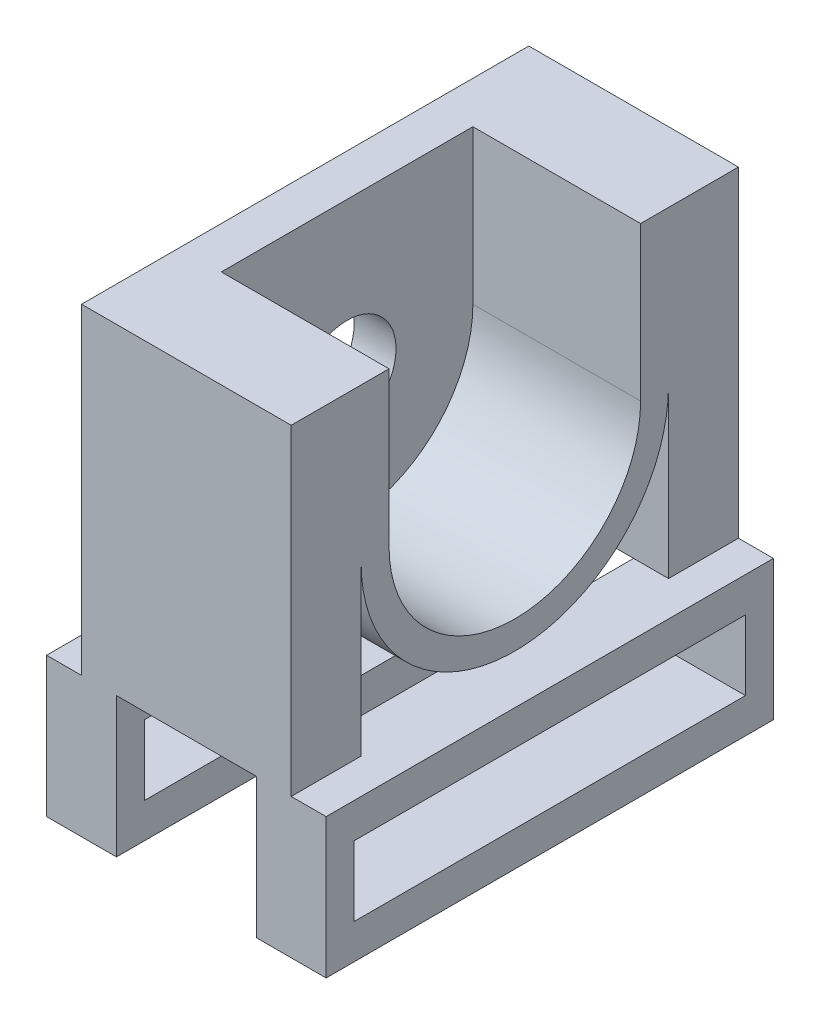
ISO-10303-21;
HEADER;
FILE_DESCRIPTION(('STEP AP214'),'2;1');
FILE_NAME('part.step','',(''),(''),'','','');
FILE_SCHEMA(('AUTOMOTIVE_DESIGN { 1 0 10303 214 1 1 1 1 }'));
ENDSEC;
DATA;
#1=APPLICATION_CONTEXT('core data for automotive mechanical design processes');
#2=APPLICATION_PROTOCOL_DEFINITION('international standard','automotive_design',2000,#1);
#3=PRODUCT_CONTEXT('',#1,'mechanical');
#4=PRODUCT('Part','Part','',(#3));
#5=PRODUCT_RELATED_PRODUCT_CATEGORY('part','',(#4));
#6=PRODUCT_DEFINITION_FORMATION('','',#4);
#7=PRODUCT_DEFINITION_CONTEXT('part definition',#1,'design');
#8=PRODUCT_DEFINITION('design','',#6,#7);
#9=PRODUCT_DEFINITION_SHAPE('','',#8);
#10=(LENGTH_UNIT() NAMED_UNIT(*) SI_UNIT(.MILLI.,.METRE.));
#11=(NAMED_UNIT(*) PLANE_ANGLE_UNIT() SI_UNIT($,.RADIAN.));
#12=(NAMED_UNIT(*) SI_UNIT($,.STERADIAN.) SOLID_ANGLE_UNIT());
#13=UNCERTAINTY_MEASURE_WITH_UNIT(LENGTH_MEASURE(1.E-05),#10,'distance_accuracy_value','');
#14=(GEOMETRIC_REPRESENTATION_CONTEXT(3) GLOBAL_UNCERTAINTY_ASSIGNED_CONTEXT((#13)) GLOBAL_UNIT_ASSIGNED_CONTEXT((#10,
#11,#12)) REPRESENTATION_CONTEXT('',''));
#15=CARTESIAN_POINT('',(0.,0.,0.));
#16=DIRECTION('',(0.,0.,1.));
#17=DIRECTION('',(1.,0.,0.));
#18=AXIS2_PLACEMENT_3D('',#15,#16,#17);
#19=CARTESIAN_POINT('',(0.,-22.,0.));
#20=DIRECTION('',(0.,-1.,0.));
#21=DIRECTION('',(0.,0.,-1.));
#22=AXIS2_PLACEMENT_3D('',#19,#20,#21);
#23=PLANE('',#22);
#24=DIRECTION('',(1.,0.,0.));
#25=VECTOR('',#24,1.);
#26=CARTESIAN_POINT('',(0.,-22.,-16.));
#27=LINE('',#26,#25);
#28=CARTESIAN_POINT('',(-2.5,-22.,-16.));
#29=VERTEX_POINT('',#28);
#30=CARTESIAN_POINT('',(2.5,-22.,-16.));
#31=VERTEX_POINT('',#30);
#32=EDGE_CURVE('E450',#29,#31,#27,.T.);
#33=ORIENTED_EDGE('',*,*,#32,.T.);
#34=DIRECTION('',(0.,0.,1.));
#35=VECTOR('',#34,1.);
#36=CARTESIAN_POINT('',(2.5,-22.,-16.));
#37=LINE('',#36,#35);
#38=CARTESIAN_POINT('',(2.5,-22.,16.));
#39=VERTEX_POINT('',#38);
#40=EDGE_CURVE('E308',#31,#39,#37,.T.);
#41=ORIENTED_EDGE('',*,*,#40,.T.);
#42=DIRECTION('',(-1.,0.,0.));
#43=VECTOR('',#42,1.);
#44=CARTESIAN_POINT('',(0.,-22.,16.));
#45=LINE('',#44,#43);
#46=CARTESIAN_POINT('',(-2.5,-22.,16.));
#47=VERTEX_POINT('',#46);
#48=EDGE_CURVE('E454',#39,#47,#45,.T.);
#49=ORIENTED_EDGE('',*,*,#48,.T.);
#50=DIRECTION('',(0.,0.,1.));
#51=VECTOR('',#50,1.);
#52=CARTESIAN_POINT('',(-2.5,-22.,-16.));
#53=LINE('',#52,#51);
#54=EDGE_CURVE('E394',#29,#47,#53,.T.);
#55=ORIENTED_EDGE('',*,*,#54,.F.);
#56=EDGE_LOOP('',(#33,#41,#49,#55));
#57=FACE_BOUND('',#56,.T.);
#58=ADVANCED_FACE('F67',(#57),#23,.T.);
#59=CARTESIAN_POINT('',(0.,-12.,-16.002));
#60=DIRECTION('',(0.,-1.,0.));
#61=DIRECTION('',(1.,0.,0.));
#62=AXIS2_PLACEMENT_3D('',#59,#60,#61);
#63=PLANE('',#62);
#64=DIRECTION('',(0.,0.,1.));
#65=VECTOR('',#64,1.);
#66=CARTESIAN_POINT('',(2.5,-12.,-16.));
#67=LINE('',#66,#65);
#68=CARTESIAN_POINT('',(2.5,-12.,-11.));
#69=VERTEX_POINT('',#68);
#70=CARTESIAN_POINT('',(2.5,-12.,11.));
#71=VERTEX_POINT('',#70);
#72=EDGE_CURVE('E309',#69,#71,#67,.T.);
#73=ORIENTED_EDGE('',*,*,#72,.F.);
#74=DIRECTION('',(-1.,0.,0.));
#75=VECTOR('',#74,1.);
#76=CARTESIAN_POINT('',(0.,-12.,-11.));
#77=LINE('',#76,#75);
#78=CARTESIAN_POINT('',(0.,-12.,-11.));
#79=VERTEX_POINT('',#78);
#80=EDGE_CURVE('E443',#69,#79,#77,.T.);
#81=ORIENTED_EDGE('',*,*,#80,.T.);
#82=DIRECTION('',(0.,0.,1.));
#83=VECTOR('',#82,1.);
#84=CARTESIAN_POINT('',(0.,-12.,-16.));
#85=LINE('',#84,#83);
#86=CARTESIAN_POINT('',(0.,-12.,-16.));
#87=VERTEX_POINT('',#86);
#88=EDGE_CURVE('E371',#87,#79,#85,.T.);
#89=ORIENTED_EDGE('',*,*,#88,.F.);
#90=DIRECTION('',(1.,0.,0.));
#91=VECTOR('',#90,1.);
#92=CARTESIAN_POINT('',(-2.5,-12.,-16.));
#93=LINE('',#92,#91);
#94=CARTESIAN_POINT('',(-2.5,-12.,-16.));
#95=VERTEX_POINT('',#94);
#96=EDGE_CURVE('E407',#95,#87,#93,.T.);
#97=ORIENTED_EDGE('',*,*,#96,.F.);
#98=DIRECTION('',(0.,0.,1.));
#99=VECTOR('',#98,1.);
#100=CARTESIAN_POINT('',(-2.5,-12.,-16.));
#101=LINE('',#100,#99);
#102=CARTESIAN_POINT('',(-2.5,-12.,16.));
#103=VERTEX_POINT('',#102);
#104=EDGE_CURVE('E387',#95,#103,#101,.T.);
#105=ORIENTED_EDGE('',*,*,#104,.T.);
#106=DIRECTION('',(1.,0.,0.));
#107=VECTOR('',#106,1.);
#108=CARTESIAN_POINT('',(-2.5,-12.,16.));
#109=LINE('',#108,#107);
#110=CARTESIAN_POINT('',(0.,-12.,16.));
#111=VERTEX_POINT('',#110);
#112=EDGE_CURVE('E402',#103,#111,#109,.T.);
#113=ORIENTED_EDGE('',*,*,#112,.T.);
#114=CARTESIAN_POINT('',(0.,-12.,11.));
#115=VERTEX_POINT('',#114);
#116=EDGE_CURVE('E406',#115,#111,#85,.T.);
#117=ORIENTED_EDGE('',*,*,#116,.F.);
#118=DIRECTION('',(1.,0.,0.));
#119=VECTOR('',#118,1.);
#120=CARTESIAN_POINT('',(0.,-12.,11.));
#121=LINE('',#120,#119);
#122=EDGE_CURVE('E439',#115,#71,#121,.T.);
#123=ORIENTED_EDGE('',*,*,#122,.T.);
#124=EDGE_LOOP('',(#73,#81,#89,#97,#105,#113,#117,#123));
#125=FACE_BOUND('',#124,.T.);
#126=ADVANCED_FACE('F677',(#125),#63,.F.);
#127=CARTESIAN_POINT('',(17.5,0.,-14.));
#128=DIRECTION('',(0.,0.,1.));
#129=DIRECTION('',(1.,0.,0.));
#130=AXIS2_PLACEMENT_3D('',#127,#128,#129);
#131=PLANE('',#130);
#132=DIRECTION('',(-1.,0.,0.));
#133=VECTOR('',#132,1.);
#134=CARTESIAN_POINT('',(17.5,-19.5,-14.));
#135=LINE('',#134,#133);
#136=CARTESIAN_POINT('',(2.5,-19.5,-14.));
#137=VERTEX_POINT('',#136);
#138=CARTESIAN_POINT('',(-2.5,-19.5,-14.));
#139=VERTEX_POINT('',#138);
#140=EDGE_CURVE('E372',#137,#139,#135,.T.);
#141=ORIENTED_EDGE('',*,*,#140,.F.);
#142=DIRECTION('',(0.,1.,0.));
#143=VECTOR('',#142,1.);
#144=CARTESIAN_POINT('',(2.5,0.,-14.));
#145=LINE('',#144,#143);
#146=CARTESIAN_POINT('',(2.5,-14.5,-14.));
#147=VERTEX_POINT('',#146);
#148=EDGE_CURVE('E320',#137,#147,#145,.T.);
#149=ORIENTED_EDGE('',*,*,#148,.T.);
#150=DIRECTION('',(-1.,0.,0.));
#151=VECTOR('',#150,1.);
#152=CARTESIAN_POINT('',(17.5,-14.5,-14.));
#153=LINE('',#152,#151);
#154=CARTESIAN_POINT('',(-2.5,-14.5,-14.));
#155=VERTEX_POINT('',#154);
#156=EDGE_CURVE('E377',#147,#155,#153,.T.);
#157=ORIENTED_EDGE('',*,*,#156,.T.);
#158=DIRECTION('',(0.,1.,0.));
#159=VECTOR('',#158,1.);
#160=CARTESIAN_POINT('',(-2.5,0.,-14.));
#161=LINE('',#160,#159);
#162=EDGE_CURVE('E341',#139,#155,#161,.T.);
#163=ORIENTED_EDGE('',*,*,#162,.F.);
#164=EDGE_LOOP('',(#141,#149,#157,#163));
#165=FACE_BOUND('',#164,.T.);
#166=ADVANCED_FACE('F666',(#165),#131,.T.);
#167=CARTESIAN_POINT('',(17.5,-19.5,0.));
#168=DIRECTION('',(0.,-1.,0.));
#169=DIRECTION('',(0.,0.,-1.));
#170=AXIS2_PLACEMENT_3D('',#167,#168,#169);
#171=PLANE('',#170);
#172=DIRECTION('',(0.,0.,1.));
#173=VECTOR('',#172,1.);
#174=CARTESIAN_POINT('',(2.5,-19.5,0.));
#175=LINE('',#174,#173);
#176=CARTESIAN_POINT('',(2.5,-19.5,14.));
#177=VERTEX_POINT('',#176);
#178=EDGE_CURVE('E317',#137,#177,#175,.T.);
#179=ORIENTED_EDGE('',*,*,#178,.F.);
#180=ORIENTED_EDGE('',*,*,#140,.T.);
#181=DIRECTION('',(0.,0.,1.));
#182=VECTOR('',#181,1.);
#183=CARTESIAN_POINT('',(-2.5,-19.5,0.));
#184=LINE('',#183,#182);
#185=CARTESIAN_POINT('',(-2.5,-19.5,14.));
#186=VERTEX_POINT('',#185);
#187=EDGE_CURVE('E335',#139,#186,#184,.T.);
#188=ORIENTED_EDGE('',*,*,#187,.T.);
#189=DIRECTION('',(-1.,0.,0.));
#190=VECTOR('',#189,1.);
#191=CARTESIAN_POINT('',(17.5,-19.5,14.));
#192=LINE('',#191,#190);
#193=EDGE_CURVE('E352',#177,#186,#192,.T.);
#194=ORIENTED_EDGE('',*,*,#193,.F.);
#195=EDGE_LOOP('',(#179,#180,#188,#194));
#196=FACE_BOUND('',#195,.T.);
#197=ADVANCED_FACE('F658',(#196),#171,.F.);
#198=CARTESIAN_POINT('',(17.5,0.,14.));
#199=DIRECTION('',(0.,0.,1.));
#200=DIRECTION('',(1.,0.,0.));
#201=AXIS2_PLACEMENT_3D('',#198,#199,#200);
#202=PLANE('',#201);
#203=DIRECTION('',(0.,1.,0.));
#204=VECTOR('',#203,1.);
#205=CARTESIAN_POINT('',(2.5,0.,14.));
#206=LINE('',#205,#204);
#207=CARTESIAN_POINT('',(2.5,-14.5,14.));
#208=VERTEX_POINT('',#207);
#209=EDGE_CURVE('E283',#177,#208,#206,.T.);
#210=ORIENTED_EDGE('',*,*,#209,.F.);
#211=ORIENTED_EDGE('',*,*,#193,.T.);
#212=DIRECTION('',(0.,1.,0.));
#213=VECTOR('',#212,1.);
#214=CARTESIAN_POINT('',(-2.5,0.,14.));
#215=LINE('',#214,#213);
#216=CARTESIAN_POINT('',(-2.5,-14.5,14.));
#217=VERTEX_POINT('',#216);
#218=EDGE_CURVE('E356',#186,#217,#215,.T.);
#219=ORIENTED_EDGE('',*,*,#218,.T.);
#220=DIRECTION('',(-1.,0.,0.));
#221=VECTOR('',#220,1.);
#222=CARTESIAN_POINT('',(17.5,-14.5,14.));
#223=LINE('',#222,#221);
#224=EDGE_CURVE('E382',#208,#217,#223,.T.);
#225=ORIENTED_EDGE('',*,*,#224,.F.);
#226=EDGE_LOOP('',(#210,#211,#219,#225));
#227=FACE_BOUND('',#226,.T.);
#228=ADVANCED_FACE('F653',(#227),#202,.F.);
#229=CARTESIAN_POINT('',(17.5,-14.5,0.));
#230=DIRECTION('',(0.,-1.,0.));
#231=DIRECTION('',(0.,0.,-1.));
#232=AXIS2_PLACEMENT_3D('',#229,#230,#231);
#233=PLANE('',#232);
#234=ORIENTED_EDGE('',*,*,#156,.F.);
#235=DIRECTION('',(0.,0.,1.));
#236=VECTOR('',#235,1.);
#237=CARTESIAN_POINT('',(2.5,-14.5,0.));
#238=LINE('',#237,#236);
#239=EDGE_CURVE('E76',#147,#208,#238,.T.);
#240=ORIENTED_EDGE('',*,*,#239,.T.);
#241=ORIENTED_EDGE('',*,*,#224,.T.);
#242=DIRECTION('',(0.,0.,1.));
#243=VECTOR('',#242,1.);
#244=CARTESIAN_POINT('',(-2.5,-14.5,0.));
#245=LINE('',#244,#243);
#246=EDGE_CURVE('E360',#155,#217,#245,.T.);
#247=ORIENTED_EDGE('',*,*,#246,.F.);
#248=EDGE_LOOP('',(#234,#240,#241,#247));
#249=FACE_BOUND('',#248,.T.);
#250=ADVANCED_FACE('F664',(#249),#233,.T.);
#251=CARTESIAN_POINT('',(17.5,0.,0.));
#252=DIRECTION('',(1.,0.,0.));
#253=DIRECTION('',(0.,0.,-1.));
#254=AXIS2_PLACEMENT_3D('',#251,#252,#253);
#255=PLANE('',#254);
#256=DIRECTION('',(0.,0.,-1.));
#257=VECTOR('',#256,1.);
#258=CARTESIAN_POINT('',(17.5,-12.,16.));
#259=LINE('',#258,#257);
#260=CARTESIAN_POINT('',(17.5,-12.,16.));
#261=VERTEX_POINT('',#260);
#262=CARTESIAN_POINT('',(17.5,-12.,-16.));
#263=VERTEX_POINT('',#262);
#264=EDGE_CURVE('E413',#261,#263,#259,.T.);
#265=ORIENTED_EDGE('',*,*,#264,.F.);
#266=DIRECTION('',(0.,1.,0.));
#267=VECTOR('',#266,1.);
#268=CARTESIAN_POINT('',(17.5,-22.,16.));
#269=LINE('',#268,#267);
#270=CARTESIAN_POINT('',(17.5,-22.,16.));
#271=VERTEX_POINT('',#270);
#272=EDGE_CURVE('E424',#271,#261,#269,.T.);
#273=ORIENTED_EDGE('',*,*,#272,.F.);
#274=DIRECTION('',(0.,0.,-1.));
#275=VECTOR('',#274,1.);
#276=CARTESIAN_POINT('',(17.5,-22.,16.));
#277=LINE('',#276,#275);
#278=CARTESIAN_POINT('',(17.5,-22.,-16.));
#279=VERTEX_POINT('',#278);
#280=EDGE_CURVE('E420',#271,#279,#277,.T.);
#281=ORIENTED_EDGE('',*,*,#280,.T.);
#282=DIRECTION('',(0.,1.,0.));
#283=VECTOR('',#282,1.);
#284=CARTESIAN_POINT('',(17.5,-22.,-16.));
#285=LINE('',#284,#283);
#286=EDGE_CURVE('E417',#279,#263,#285,.T.);
#287=ORIENTED_EDGE('',*,*,#286,.T.);
#288=EDGE_LOOP('',(#265,#273,#281,#287));
#289=FACE_BOUND('',#288,.T.);
#290=DIRECTION('',(0.,0.,1.));
#291=VECTOR('',#290,1.);
#292=CARTESIAN_POINT('',(17.5,-14.5,0.));
#293=LINE('',#292,#291);
#294=CARTESIAN_POINT('',(17.5,-14.5,-14.));
#295=VERTEX_POINT('',#294);
#296=CARTESIAN_POINT('',(17.5,-14.5,14.));
#297=VERTEX_POINT('',#296);
#298=EDGE_CURVE('E345',#295,#297,#293,.T.);
#299=ORIENTED_EDGE('',*,*,#298,.F.);
#300=DIRECTION('',(0.,1.,0.));
#301=VECTOR('',#300,1.);
#302=CARTESIAN_POINT('',(17.5,0.,-14.));
#303=LINE('',#302,#301);
#304=CARTESIAN_POINT('',(17.5,-19.5,-14.));
#305=VERTEX_POINT('',#304);
#306=EDGE_CURVE('E348',#305,#295,#303,.T.);
#307=ORIENTED_EDGE('',*,*,#306,.F.);
#308=DIRECTION('',(0.,0.,1.));
#309=VECTOR('',#308,1.);
#310=CARTESIAN_POINT('',(17.5,-19.5,0.));
#311=LINE('',#310,#309);
#312=CARTESIAN_POINT('',(17.5,-19.5,14.));
#313=VERTEX_POINT('',#312);
#314=EDGE_CURVE('E336',#305,#313,#311,.T.);
#315=ORIENTED_EDGE('',*,*,#314,.T.);
#316=DIRECTION('',(0.,1.,0.));
#317=VECTOR('',#316,1.);
#318=CARTESIAN_POINT('',(17.5,0.,14.));
#319=LINE('',#318,#317);
#320=EDGE_CURVE('E340',#313,#297,#319,.T.);
#321=ORIENTED_EDGE('',*,*,#320,.T.);
#322=EDGE_LOOP('',(#299,#307,#315,#321));
#323=FACE_BOUND('',#322,.T.);
#324=ADVANCED_FACE('F697',(#289,#323),#255,.T.);
#325=CARTESIAN_POINT('',(-2.5,0.,0.));
#326=DIRECTION('',(-1.,0.,0.));
#327=DIRECTION('',(0.,0.,1.));
#328=AXIS2_PLACEMENT_3D('',#325,#326,#327);
#329=PLANE('',#328);
#330=ORIENTED_EDGE('',*,*,#104,.F.);
#331=DIRECTION('',(0.,1.,0.));
#332=VECTOR('',#331,1.);
#333=CARTESIAN_POINT('',(-2.5,-22.,-16.));
#334=LINE('',#333,#332);
#335=EDGE_CURVE('E398',#29,#95,#334,.T.);
#336=ORIENTED_EDGE('',*,*,#335,.F.);
#337=ORIENTED_EDGE('',*,*,#54,.T.);
#338=DIRECTION('',(0.,1.,0.));
#339=VECTOR('',#338,1.);
#340=CARTESIAN_POINT('',(-2.5,-22.,16.));
#341=LINE('',#340,#339);
#342=EDGE_CURVE('E391',#47,#103,#341,.T.);
#343=ORIENTED_EDGE('',*,*,#342,.T.);
#344=EDGE_LOOP('',(#330,#336,#337,#343));
#345=FACE_BOUND('',#344,.T.);
#346=ORIENTED_EDGE('',*,*,#187,.F.);
#347=ORIENTED_EDGE('',*,*,#162,.T.);
#348=ORIENTED_EDGE('',*,*,#246,.T.);
#349=ORIENTED_EDGE('',*,*,#218,.F.);
#350=EDGE_LOOP('',(#346,#347,#348,#349));
#351=FACE_BOUND('',#350,.T.);
#352=ADVANCED_FACE('F662',(#345,#351),#329,.T.);
#353=CARTESIAN_POINT('',(15.,0.,0.));
#354=DIRECTION('',(1.,0.,0.));
#355=DIRECTION('',(0.,0.,-1.));
#356=AXIS2_PLACEMENT_3D('',#353,#354,#355);
#357=PLANE('',#356);
#358=DIRECTION('',(0.,-1.,0.));
#359=VECTOR('',#358,1.);
#360=CARTESIAN_POINT('',(15.,11.,16.));
#361=LINE('',#360,#359);
#362=CARTESIAN_POINT('',(15.,11.,16.));
#363=VERTEX_POINT('',#362);
#364=CARTESIAN_POINT('',(15.,-12.,16.));
#365=VERTEX_POINT('',#364);
#366=EDGE_CURVE('E465',#363,#365,#361,.T.);
#367=ORIENTED_EDGE('',*,*,#366,.T.);
#368=DIRECTION('',(0.,0.,-1.));
#369=VECTOR('',#368,1.);
#370=CARTESIAN_POINT('',(15.,-12.,16.));
#371=LINE('',#370,#369);
#372=CARTESIAN_POINT('',(15.,-12.,11.));
#373=VERTEX_POINT('',#372);
#374=EDGE_CURVE('E410',#365,#373,#371,.T.);
#375=ORIENTED_EDGE('',*,*,#374,.T.);
#376=DIRECTION('',(0.,1.,0.));
#377=VECTOR('',#376,1.);
#378=CARTESIAN_POINT('',(15.,-16.,11.));
#379=LINE('',#378,#377);
#380=CARTESIAN_POINT('',(15.,0.,11.));
#381=VERTEX_POINT('',#380);
#382=EDGE_CURVE('E462',#373,#381,#379,.T.);
#383=ORIENTED_EDGE('',*,*,#382,.T.);
#384=CARTESIAN_POINT('',(15.,0.,0.));
#385=DIRECTION('',(1.,0.,0.));
#386=DIRECTION('',(0.,0.,-1.));
#387=AXIS2_PLACEMENT_3D('',#384,#385,#386);
#388=CIRCLE('',#387,11.);
#389=CARTESIAN_POINT('',(15.,0.,-11.));
#390=VERTEX_POINT('',#389);
#391=EDGE_CURVE('E545',#381,#390,#388,.T.);
#392=ORIENTED_EDGE('',*,*,#391,.T.);
#393=DIRECTION('',(0.,1.,0.));
#394=VECTOR('',#393,1.);
#395=CARTESIAN_POINT('',(15.,-16.,-11.));
#396=LINE('',#395,#394);
#397=CARTESIAN_POINT('',(15.,-12.,-11.));
#398=VERTEX_POINT('',#397);
#399=EDGE_CURVE('E480',#398,#390,#396,.T.);
#400=ORIENTED_EDGE('',*,*,#399,.F.);
#401=CARTESIAN_POINT('',(15.,-12.,-16.));
#402=VERTEX_POINT('',#401);
#403=EDGE_CURVE('E432',#398,#402,#371,.T.);
#404=ORIENTED_EDGE('',*,*,#403,.T.);
#405=DIRECTION('',(0.,-1.,0.));
#406=VECTOR('',#405,1.);
#407=CARTESIAN_POINT('',(15.,11.,-16.));
#408=LINE('',#407,#406);
#409=CARTESIAN_POINT('',(15.,11.,-16.));
#410=VERTEX_POINT('',#409);
#411=EDGE_CURVE('E491',#410,#402,#408,.T.);
#412=ORIENTED_EDGE('',*,*,#411,.F.);
#413=DIRECTION('',(0.,0.,1.));
#414=VECTOR('',#413,1.);
#415=CARTESIAN_POINT('',(15.,11.,11.));
#416=LINE('',#415,#414);
#417=CARTESIAN_POINT('',(15.,11.,-9.));
#418=VERTEX_POINT('',#417);
#419=EDGE_CURVE('E551',#410,#418,#416,.T.);
#420=ORIENTED_EDGE('',*,*,#419,.T.);
#421=DIRECTION('',(0.,1.,0.));
#422=VECTOR('',#421,1.);
#423=CARTESIAN_POINT('',(15.,0.,-9.));
#424=LINE('',#423,#422);
#425=CARTESIAN_POINT('',(15.,0.,-9.));
#426=VERTEX_POINT('',#425);
#427=EDGE_CURVE('E525',#426,#418,#424,.T.);
#428=ORIENTED_EDGE('',*,*,#427,.F.);
#429=CARTESIAN_POINT('',(15.,0.,0.));
#430=DIRECTION('',(1.,0.,0.));
#431=DIRECTION('',(0.,0.,-1.));
#432=AXIS2_PLACEMENT_3D('',#429,#430,#431);
#433=CIRCLE('',#432,9.);
#434=CARTESIAN_POINT('',(15.,0.,9.));
#435=VERTEX_POINT('',#434);
#436=EDGE_CURVE('E509',#435,#426,#433,.T.);
#437=ORIENTED_EDGE('',*,*,#436,.F.);
#438=DIRECTION('',(0.,1.,0.));
#439=VECTOR('',#438,1.);
#440=CARTESIAN_POINT('',(15.,0.,9.));
#441=LINE('',#440,#439);
#442=CARTESIAN_POINT('',(15.,11.,9.));
#443=VERTEX_POINT('',#442);
#444=EDGE_CURVE('E500',#435,#443,#441,.T.);
#445=ORIENTED_EDGE('',*,*,#444,.T.);
#446=EDGE_CURVE('E549',#443,#363,#416,.T.);
#447=ORIENTED_EDGE('',*,*,#446,.T.);
#448=EDGE_LOOP('',(#367,#375,#383,#392,#400,#404,#412,#420,#428,#437,#445,#447));
#449=FACE_BOUND('',#448,.T.);
#450=ADVANCED_FACE('F582',(#449),#357,.T.);
#451=CARTESIAN_POINT('',(0.,-16.,-11.));
#452=DIRECTION('',(0.,0.,1.));
#453=DIRECTION('',(1.,0.,0.));
#454=AXIS2_PLACEMENT_3D('',#451,#452,#453);
#455=PLANE('',#454);
#456=DIRECTION('',(0.,1.,0.));
#457=VECTOR('',#456,1.);
#458=CARTESIAN_POINT('',(0.,-16.,-11.));
#459=LINE('',#458,#457);
#460=CARTESIAN_POINT('',(0.,0.,-11.));
#461=VERTEX_POINT('',#460);
#462=EDGE_CURVE('E477',#79,#461,#459,.T.);
#463=ORIENTED_EDGE('',*,*,#462,.F.);
#464=ORIENTED_EDGE('',*,*,#80,.F.);
#465=CARTESIAN_POINT('',(12.5,-12.,-11.));
#466=VERTEX_POINT('',#465);
#467=EDGE_CURVE('E449',#466,#69,#77,.T.);
#468=ORIENTED_EDGE('',*,*,#467,.F.);
#469=EDGE_CURVE('E445',#398,#466,#77,.T.);
#470=ORIENTED_EDGE('',*,*,#469,.F.);
#471=ORIENTED_EDGE('',*,*,#399,.T.);
#472=DIRECTION('',(-1.,0.,0.));
#473=VECTOR('',#472,1.);
#474=CARTESIAN_POINT('',(15.,0.,-11.));
#475=LINE('',#474,#473);
#476=EDGE_CURVE('E564',#390,#461,#475,.T.);
#477=ORIENTED_EDGE('',*,*,#476,.T.);
#478=EDGE_LOOP('',(#463,#464,#468,#470,#471,#477));
#479=FACE_BOUND('',#478,.T.);
#480=ADVANCED_FACE('F627',(#479),#455,.T.);
#481=CARTESIAN_POINT('',(0.,-16.,11.));
#482=DIRECTION('',(0.,0.,1.));
#483=DIRECTION('',(1.,0.,0.));
#484=AXIS2_PLACEMENT_3D('',#481,#482,#483);
#485=PLANE('',#484);
#486=ORIENTED_EDGE('',*,*,#122,.F.);
#487=DIRECTION('',(0.,1.,0.));
#488=VECTOR('',#487,1.);
#489=CARTESIAN_POINT('',(0.,-16.,11.));
#490=LINE('',#489,#488);
#491=CARTESIAN_POINT('',(0.,0.,11.));
#492=VERTEX_POINT('',#491);
#493=EDGE_CURVE('E459',#115,#492,#490,.T.);
#494=ORIENTED_EDGE('',*,*,#493,.T.);
#495=DIRECTION('',(-1.,0.,0.));
#496=VECTOR('',#495,1.);
#497=CARTESIAN_POINT('',(15.,0.,11.));
#498=LINE('',#497,#496);
#499=EDGE_CURVE('E555',#381,#492,#498,.T.);
#500=ORIENTED_EDGE('',*,*,#499,.F.);
#501=ORIENTED_EDGE('',*,*,#382,.F.);
#502=CARTESIAN_POINT('',(12.5,-12.,11.));
#503=VERTEX_POINT('',#502);
#504=EDGE_CURVE('E436',#503,#373,#121,.T.);
#505=ORIENTED_EDGE('',*,*,#504,.F.);
#506=EDGE_CURVE('E444',#71,#503,#121,.T.);
#507=ORIENTED_EDGE('',*,*,#506,.F.);
#508=EDGE_LOOP('',(#486,#494,#500,#501,#505,#507));
#509=FACE_BOUND('',#508,.T.);
#510=ADVANCED_FACE('F619',(#509),#485,.F.);
#511=CARTESIAN_POINT('',(15.,11.,11.));
#512=DIRECTION('',(0.,-1.,0.));
#513=DIRECTION('',(0.,0.,-1.));
#514=AXIS2_PLACEMENT_3D('',#511,#512,#513);
#515=PLANE('',#514);
#516=DIRECTION('',(1.,0.,0.));
#517=VECTOR('',#516,1.);
#518=CARTESIAN_POINT('',(3.,11.,9.));
#519=LINE('',#518,#517);
#520=CARTESIAN_POINT('',(3.,11.,9.));
#521=VERTEX_POINT('',#520);
#522=EDGE_CURVE('E541',#521,#443,#519,.T.);
#523=ORIENTED_EDGE('',*,*,#522,.F.);
#524=DIRECTION('',(0.,0.,-1.));
#525=VECTOR('',#524,1.);
#526=CARTESIAN_POINT('',(3.,11.,9.));
#527=LINE('',#526,#525);
#528=CARTESIAN_POINT('',(3.,11.,-9.));
#529=VERTEX_POINT('',#528);
#530=EDGE_CURVE('E508',#521,#529,#527,.T.);
#531=ORIENTED_EDGE('',*,*,#530,.T.);
#532=DIRECTION('',(1.,0.,0.));
#533=VECTOR('',#532,1.);
#534=CARTESIAN_POINT('',(3.,11.,-9.));
#535=LINE('',#534,#533);
#536=EDGE_CURVE('E537',#529,#418,#535,.T.);
#537=ORIENTED_EDGE('',*,*,#536,.T.);
#538=ORIENTED_EDGE('',*,*,#419,.F.);
#539=DIRECTION('',(-1.,0.,0.));
#540=VECTOR('',#539,1.);
#541=CARTESIAN_POINT('',(15.,11.,-16.));
#542=LINE('',#541,#540);
#543=CARTESIAN_POINT('',(0.,11.,-16.));
#544=VERTEX_POINT('',#543);
#545=EDGE_CURVE('E487',#410,#544,#542,.T.);
#546=ORIENTED_EDGE('',*,*,#545,.T.);
#547=DIRECTION('',(0.,0.,1.));
#548=VECTOR('',#547,1.);
#549=CARTESIAN_POINT('',(0.,11.,11.));
#550=LINE('',#549,#548);
#551=CARTESIAN_POINT('',(0.,11.,16.));
#552=VERTEX_POINT('',#551);
#553=EDGE_CURVE('E550',#544,#552,#550,.T.);
#554=ORIENTED_EDGE('',*,*,#553,.T.);
#555=DIRECTION('',(1.,0.,0.));
#556=VECTOR('',#555,1.);
#557=CARTESIAN_POINT('',(0.,11.,16.));
#558=LINE('',#557,#556);
#559=EDGE_CURVE('E469',#552,#363,#558,.T.);
#560=ORIENTED_EDGE('',*,*,#559,.T.);
#561=ORIENTED_EDGE('',*,*,#446,.F.);
#562=EDGE_LOOP('',(#523,#531,#537,#538,#546,#554,#560,#561));
#563=FACE_BOUND('',#562,.T.);
#564=ADVANCED_FACE('F590',(#563),#515,.F.);
#565=CARTESIAN_POINT('',(15.,0.,0.));
#566=DIRECTION('',(-1.,0.,0.));
#567=DIRECTION('',(0.,0.,1.));
#568=AXIS2_PLACEMENT_3D('',#565,#566,#567);
#569=CYLINDRICAL_SURFACE('',#568,11.);
#570=CARTESIAN_POINT('',(0.,0.,0.));
#571=DIRECTION('',(1.,0.,0.));
#572=DIRECTION('',(0.,0.,-1.));
#573=AXIS2_PLACEMENT_3D('',#570,#571,#572);
#574=CIRCLE('',#573,11.);
#575=EDGE_CURVE('E544',#492,#461,#574,.T.);
#576=ORIENTED_EDGE('',*,*,#575,.T.);
#577=ORIENTED_EDGE('',*,*,#476,.F.);
#578=ORIENTED_EDGE('',*,*,#391,.F.);
#579=ORIENTED_EDGE('',*,*,#499,.T.);
#580=EDGE_LOOP('',(#576,#577,#578,#579));
#581=FACE_BOUND('',#580,.T.);
#582=ADVANCED_FACE('F69',(#581),#569,.T.);
#583=CARTESIAN_POINT('',(0.,0.,0.));
#584=DIRECTION('',(1.,0.,0.));
#585=DIRECTION('',(0.,0.,-1.));
#586=AXIS2_PLACEMENT_3D('',#583,#584,#585);
#587=PLANE('',#586);
#588=DIRECTION('',(0.,-1.,0.));
#589=VECTOR('',#588,1.);
#590=CARTESIAN_POINT('',(0.,11.,-16.));
#591=LINE('',#590,#589);
#592=EDGE_CURVE('E483',#544,#87,#591,.T.);
#593=ORIENTED_EDGE('',*,*,#592,.T.);
#594=ORIENTED_EDGE('',*,*,#88,.T.);
#595=ORIENTED_EDGE('',*,*,#462,.T.);
#596=ORIENTED_EDGE('',*,*,#575,.F.);
#597=ORIENTED_EDGE('',*,*,#493,.F.);
#598=ORIENTED_EDGE('',*,*,#116,.T.);
#599=DIRECTION('',(0.,-1.,0.));
#600=VECTOR('',#599,1.);
#601=CARTESIAN_POINT('',(0.,11.,16.));
#602=LINE('',#601,#600);
#603=EDGE_CURVE('E473',#552,#111,#602,.T.);
#604=ORIENTED_EDGE('',*,*,#603,.F.);
#605=ORIENTED_EDGE('',*,*,#553,.F.);
#606=EDGE_LOOP('',(#593,#594,#595,#596,#597,#598,#604,#605));
#607=FACE_BOUND('',#606,.T.);
#608=CARTESIAN_POINT('',(0.,0.,0.));
#609=DIRECTION('',(1.,0.,0.));
#610=DIRECTION('',(0.,0.,-1.));
#611=AXIS2_PLACEMENT_3D('',#608,#609,#610);
#612=CIRCLE('',#611,3.5);
#613=CARTESIAN_POINT('',(0.,0.,-3.5));
#614=VERTEX_POINT('',#613);
#615=EDGE_CURVE('E496',#614,#614,#612,.T.);
#616=ORIENTED_EDGE('',*,*,#615,.T.);
#617=EDGE_LOOP('',(#616));
#618=FACE_BOUND('',#617,.T.);
#619=ADVANCED_FACE('F742',(#607,#618),#587,.F.);
#620=CARTESIAN_POINT('',(3.,0.,9.));
#621=DIRECTION('',(0.,0.,-1.));
#622=DIRECTION('',(-1.,0.,0.));
#623=AXIS2_PLACEMENT_3D('',#620,#621,#622);
#624=PLANE('',#623);
#625=ORIENTED_EDGE('',*,*,#444,.F.);
#626=DIRECTION('',(1.,0.,0.));
#627=VECTOR('',#626,1.);
#628=CARTESIAN_POINT('',(3.,0.,9.));
#629=LINE('',#628,#627);
#630=CARTESIAN_POINT('',(3.,0.,9.));
#631=VERTEX_POINT('',#630);
#632=EDGE_CURVE('E521',#631,#435,#629,.T.);
#633=ORIENTED_EDGE('',*,*,#632,.F.);
#634=DIRECTION('',(0.,1.,0.));
#635=VECTOR('',#634,1.);
#636=CARTESIAN_POINT('',(3.,0.,9.));
#637=LINE('',#636,#635);
#638=EDGE_CURVE('E504',#631,#521,#637,.T.);
#639=ORIENTED_EDGE('',*,*,#638,.T.);
#640=ORIENTED_EDGE('',*,*,#522,.T.);
#641=EDGE_LOOP('',(#625,#633,#639,#640));
#642=FACE_BOUND('',#641,.T.);
#643=ADVANCED_FACE('F601',(#642),#624,.T.);
#644=CARTESIAN_POINT('',(3.,0.,-9.));
#645=DIRECTION('',(0.,0.,-1.));
#646=DIRECTION('',(-1.,0.,0.));
#647=AXIS2_PLACEMENT_3D('',#644,#645,#646);
#648=PLANE('',#647);
#649=ORIENTED_EDGE('',*,*,#427,.T.);
#650=ORIENTED_EDGE('',*,*,#536,.F.);
#651=DIRECTION('',(0.,1.,0.));
#652=VECTOR('',#651,1.);
#653=CARTESIAN_POINT('',(3.,0.,-9.));
#654=LINE('',#653,#652);
#655=CARTESIAN_POINT('',(3.,0.,-9.));
#656=VERTEX_POINT('',#655);
#657=EDGE_CURVE('E513',#656,#529,#654,.T.);
#658=ORIENTED_EDGE('',*,*,#657,.F.);
#659=DIRECTION('',(1.,0.,0.));
#660=VECTOR('',#659,1.);
#661=CARTESIAN_POINT('',(3.,0.,-9.));
#662=LINE('',#661,#660);
#663=EDGE_CURVE('E534',#656,#426,#662,.T.);
#664=ORIENTED_EDGE('',*,*,#663,.T.);
#665=EDGE_LOOP('',(#649,#650,#658,#664));
#666=FACE_BOUND('',#665,.T.);
#667=ADVANCED_FACE('F594',(#666),#648,.F.);
#668=CARTESIAN_POINT('',(3.,0.,0.));
#669=DIRECTION('',(1.,0.,0.));
#670=DIRECTION('',(0.,0.,-1.));
#671=AXIS2_PLACEMENT_3D('',#668,#669,#670);
#672=CYLINDRICAL_SURFACE('',#671,9.);
#673=ORIENTED_EDGE('',*,*,#436,.T.);
#674=ORIENTED_EDGE('',*,*,#663,.F.);
#675=CARTESIAN_POINT('',(3.,0.,0.));
#676=DIRECTION('',(1.,0.,0.));
#677=DIRECTION('',(0.,0.,-1.));
#678=AXIS2_PLACEMENT_3D('',#675,#676,#677);
#679=CIRCLE('',#678,9.);
#680=EDGE_CURVE('E517',#631,#656,#679,.T.);
#681=ORIENTED_EDGE('',*,*,#680,.F.);
#682=ORIENTED_EDGE('',*,*,#632,.T.);
#683=EDGE_LOOP('',(#673,#674,#681,#682));
#684=FACE_BOUND('',#683,.T.);
#685=ADVANCED_FACE('F598',(#684),#672,.F.);
#686=CARTESIAN_POINT('',(3.,0.,0.));
#687=DIRECTION('',(1.,0.,0.));
#688=DIRECTION('',(0.,0.,-1.));
#689=AXIS2_PLACEMENT_3D('',#686,#687,#688);
#690=PLANE('',#689);
#691=CARTESIAN_POINT('',(3.,0.,0.));
#692=DIRECTION('',(1.,0.,0.));
#693=DIRECTION('',(0.,0.,-1.));
#694=AXIS2_PLACEMENT_3D('',#691,#692,#693);
#695=CIRCLE('',#694,3.5);
#696=CARTESIAN_POINT('',(3.,0.,-3.5));
#697=VERTEX_POINT('',#696);
#698=EDGE_CURVE('E495',#697,#697,#695,.T.);
#699=ORIENTED_EDGE('',*,*,#698,.F.);
#700=EDGE_LOOP('',(#699));
#701=FACE_BOUND('',#700,.T.);
#702=ORIENTED_EDGE('',*,*,#638,.F.);
#703=ORIENTED_EDGE('',*,*,#680,.T.);
#704=ORIENTED_EDGE('',*,*,#657,.T.);
#705=ORIENTED_EDGE('',*,*,#530,.F.);
#706=EDGE_LOOP('',(#702,#703,#704,#705));
#707=FACE_BOUND('',#706,.T.);
#708=ADVANCED_FACE('F603',(#701,#707),#690,.T.);
#709=CARTESIAN_POINT('',(0.,0.,0.));
#710=DIRECTION('',(1.,0.,0.));
#711=DIRECTION('',(0.,0.,-1.));
#712=AXIS2_PLACEMENT_3D('',#709,#710,#711);
#713=CYLINDRICAL_SURFACE('',#712,3.5);
#714=ORIENTED_EDGE('',*,*,#615,.F.);
#715=EDGE_LOOP('',(#714));
#716=FACE_BOUND('',#715,.T.);
#717=ORIENTED_EDGE('',*,*,#698,.T.);
#718=EDGE_LOOP('',(#717));
#719=FACE_BOUND('',#718,.T.);
#720=ADVANCED_FACE('F750',(#716,#719),#713,.F.);
#721=CARTESIAN_POINT('',(0.,0.,-16.));
#722=DIRECTION('',(0.,0.,1.));
#723=DIRECTION('',(1.,0.,0.));
#724=AXIS2_PLACEMENT_3D('',#721,#722,#723);
#725=PLANE('',#724);
#726=CARTESIAN_POINT('',(12.5,-22.,-16.));
#727=VERTEX_POINT('',#726);
#728=EDGE_CURVE('E289',#727,#279,#27,.T.);
#729=ORIENTED_EDGE('',*,*,#728,.F.);
#730=DIRECTION('',(0.,1.,0.));
#731=VECTOR('',#730,1.);
#732=CARTESIAN_POINT('',(12.5,-22.,-16.));
#733=LINE('',#732,#731);
#734=CARTESIAN_POINT('',(12.5,-12.,-16.));
#735=VERTEX_POINT('',#734);
#736=EDGE_CURVE('E273',#727,#735,#733,.T.);
#737=ORIENTED_EDGE('',*,*,#736,.T.);
#738=DIRECTION('',(1.,0.,0.));
#739=VECTOR('',#738,1.);
#740=CARTESIAN_POINT('',(2.5,-12.,-16.));
#741=LINE('',#740,#739);
#742=CARTESIAN_POINT('',(2.5,-12.,-16.));
#743=VERTEX_POINT('',#742);
#744=EDGE_CURVE('E264',#743,#735,#741,.T.);
#745=ORIENTED_EDGE('',*,*,#744,.F.);
#746=DIRECTION('',(0.,1.,0.));
#747=VECTOR('',#746,1.);
#748=CARTESIAN_POINT('',(2.5,-22.,-16.));
#749=LINE('',#748,#747);
#750=EDGE_CURVE('E291',#31,#743,#749,.T.);
#751=ORIENTED_EDGE('',*,*,#750,.F.);
#752=ORIENTED_EDGE('',*,*,#32,.F.);
#753=ORIENTED_EDGE('',*,*,#335,.T.);
#754=ORIENTED_EDGE('',*,*,#96,.T.);
#755=ORIENTED_EDGE('',*,*,#592,.F.);
#756=ORIENTED_EDGE('',*,*,#545,.F.);
#757=ORIENTED_EDGE('',*,*,#411,.T.);
#758=DIRECTION('',(-1.,0.,0.));
#759=VECTOR('',#758,1.);
#760=CARTESIAN_POINT('',(17.5,-12.,-16.));
#761=LINE('',#760,#759);
#762=EDGE_CURVE('E428',#263,#402,#761,.T.);
#763=ORIENTED_EDGE('',*,*,#762,.F.);
#764=ORIENTED_EDGE('',*,*,#286,.F.);
#765=EDGE_LOOP('',(#729,#737,#745,#751,#752,#753,#754,#755,#756,#757,#763,#764));
#766=FACE_BOUND('',#765,.T.);
#767=ADVANCED_FACE('F287',(#766),#725,.F.);
#768=CARTESIAN_POINT('',(0.,0.,16.));
#769=DIRECTION('',(0.,0.,-1.));
#770=DIRECTION('',(-1.,0.,0.));
#771=AXIS2_PLACEMENT_3D('',#768,#769,#770);
#772=PLANE('',#771);
#773=DIRECTION('',(1.,0.,0.));
#774=VECTOR('',#773,1.);
#775=CARTESIAN_POINT('',(2.5,-12.,16.));
#776=LINE('',#775,#774);
#777=CARTESIAN_POINT('',(2.5,-12.,16.));
#778=VERTEX_POINT('',#777);
#779=CARTESIAN_POINT('',(12.5,-12.,16.));
#780=VERTEX_POINT('',#779);
#781=EDGE_CURVE('E297',#778,#780,#776,.T.);
#782=ORIENTED_EDGE('',*,*,#781,.T.);
#783=DIRECTION('',(0.,1.,0.));
#784=VECTOR('',#783,1.);
#785=CARTESIAN_POINT('',(12.5,-22.,16.));
#786=LINE('',#785,#784);
#787=CARTESIAN_POINT('',(12.5,-22.,16.));
#788=VERTEX_POINT('',#787);
#789=EDGE_CURVE('E301',#788,#780,#786,.T.);
#790=ORIENTED_EDGE('',*,*,#789,.F.);
#791=EDGE_CURVE('E455',#271,#788,#45,.T.);
#792=ORIENTED_EDGE('',*,*,#791,.F.);
#793=ORIENTED_EDGE('',*,*,#272,.T.);
#794=DIRECTION('',(-1.,0.,0.));
#795=VECTOR('',#794,1.);
#796=CARTESIAN_POINT('',(17.5,-12.,16.));
#797=LINE('',#796,#795);
#798=EDGE_CURVE('E433',#261,#365,#797,.T.);
#799=ORIENTED_EDGE('',*,*,#798,.T.);
#800=ORIENTED_EDGE('',*,*,#366,.F.);
#801=ORIENTED_EDGE('',*,*,#559,.F.);
#802=ORIENTED_EDGE('',*,*,#603,.T.);
#803=ORIENTED_EDGE('',*,*,#112,.F.);
#804=ORIENTED_EDGE('',*,*,#342,.F.);
#805=ORIENTED_EDGE('',*,*,#48,.F.);
#806=DIRECTION('',(0.,1.,0.));
#807=VECTOR('',#806,1.);
#808=CARTESIAN_POINT('',(2.5,-22.,16.));
#809=LINE('',#808,#807);
#810=EDGE_CURVE('E83',#39,#778,#809,.T.);
#811=ORIENTED_EDGE('',*,*,#810,.T.);
#812=EDGE_LOOP('',(#782,#790,#792,#793,#799,#800,#801,#802,#803,#804,#805,#811));
#813=FACE_BOUND('',#812,.T.);
#814=ADVANCED_FACE('F609',(#813),#772,.F.);
#815=DIRECTION('',(0.,0.,1.));
#816=VECTOR('',#815,1.);
#817=CARTESIAN_POINT('',(12.5,-22.,-16.));
#818=LINE('',#817,#816);
#819=EDGE_CURVE('E312',#727,#788,#818,.T.);
#820=ORIENTED_EDGE('',*,*,#819,.F.);
#821=ORIENTED_EDGE('',*,*,#728,.T.);
#822=ORIENTED_EDGE('',*,*,#280,.F.);
#823=ORIENTED_EDGE('',*,*,#791,.T.);
#824=EDGE_LOOP('',(#820,#821,#822,#823));
#825=FACE_BOUND('',#824,.T.);
#826=ADVANCED_FACE('F679',(#825),#23,.T.);
#827=ORIENTED_EDGE('',*,*,#469,.T.);
#828=DIRECTION('',(0.,0.,1.));
#829=VECTOR('',#828,1.);
#830=CARTESIAN_POINT('',(12.5,-12.,-16.));
#831=LINE('',#830,#829);
#832=EDGE_CURVE('E281',#466,#503,#831,.T.);
#833=ORIENTED_EDGE('',*,*,#832,.T.);
#834=ORIENTED_EDGE('',*,*,#504,.T.);
#835=ORIENTED_EDGE('',*,*,#374,.F.);
#836=ORIENTED_EDGE('',*,*,#798,.F.);
#837=ORIENTED_EDGE('',*,*,#264,.T.);
#838=ORIENTED_EDGE('',*,*,#762,.T.);
#839=ORIENTED_EDGE('',*,*,#403,.F.);
#840=EDGE_LOOP('',(#827,#833,#834,#835,#836,#837,#838,#839));
#841=FACE_BOUND('',#840,.T.);
#842=ADVANCED_FACE('F613',(#841),#63,.F.);
#843=DIRECTION('',(0.,1.,0.));
#844=VECTOR('',#843,1.);
#845=CARTESIAN_POINT('',(12.5,0.,-14.));
#846=LINE('',#845,#844);
#847=CARTESIAN_POINT('',(12.5,-19.5,-14.));
#848=VERTEX_POINT('',#847);
#849=CARTESIAN_POINT('',(12.5,-14.5,-14.));
#850=VERTEX_POINT('',#849);
#851=EDGE_CURVE('E332',#848,#850,#846,.T.);
#852=ORIENTED_EDGE('',*,*,#851,.F.);
#853=EDGE_CURVE('E367',#305,#848,#135,.T.);
#854=ORIENTED_EDGE('',*,*,#853,.F.);
#855=ORIENTED_EDGE('',*,*,#306,.T.);
#856=EDGE_CURVE('E373',#295,#850,#153,.T.);
#857=ORIENTED_EDGE('',*,*,#856,.T.);
#858=EDGE_LOOP('',(#852,#854,#855,#857));
#859=FACE_BOUND('',#858,.T.);
#860=ADVANCED_FACE('F693',(#859),#131,.T.);
#861=ORIENTED_EDGE('',*,*,#853,.T.);
#862=DIRECTION('',(0.,0.,1.));
#863=VECTOR('',#862,1.);
#864=CARTESIAN_POINT('',(12.5,-19.5,0.));
#865=LINE('',#864,#863);
#866=CARTESIAN_POINT('',(12.5,-19.5,14.));
#867=VERTEX_POINT('',#866);
#868=EDGE_CURVE('E328',#848,#867,#865,.T.);
#869=ORIENTED_EDGE('',*,*,#868,.T.);
#870=EDGE_CURVE('E383',#313,#867,#192,.T.);
#871=ORIENTED_EDGE('',*,*,#870,.F.);
#872=ORIENTED_EDGE('',*,*,#314,.F.);
#873=EDGE_LOOP('',(#861,#869,#871,#872));
#874=FACE_BOUND('',#873,.T.);
#875=ADVANCED_FACE('F712',(#874),#171,.F.);
#876=ORIENTED_EDGE('',*,*,#870,.T.);
#877=DIRECTION('',(0.,1.,0.));
#878=VECTOR('',#877,1.);
#879=CARTESIAN_POINT('',(12.5,0.,14.));
#880=LINE('',#879,#878);
#881=CARTESIAN_POINT('',(12.5,-14.5,14.));
#882=VERTEX_POINT('',#881);
#883=EDGE_CURVE('E324',#867,#882,#880,.T.);
#884=ORIENTED_EDGE('',*,*,#883,.T.);
#885=EDGE_CURVE('E378',#297,#882,#223,.T.);
#886=ORIENTED_EDGE('',*,*,#885,.F.);
#887=ORIENTED_EDGE('',*,*,#320,.F.);
#888=EDGE_LOOP('',(#876,#884,#886,#887));
#889=FACE_BOUND('',#888,.T.);
#890=ADVANCED_FACE('F709',(#889),#202,.F.);
#891=DIRECTION('',(0.,0.,1.));
#892=VECTOR('',#891,1.);
#893=CARTESIAN_POINT('',(12.5,-14.5,0.));
#894=LINE('',#893,#892);
#895=EDGE_CURVE('E12',#850,#882,#894,.T.);
#896=ORIENTED_EDGE('',*,*,#895,.F.);
#897=ORIENTED_EDGE('',*,*,#856,.F.);
#898=ORIENTED_EDGE('',*,*,#298,.T.);
#899=ORIENTED_EDGE('',*,*,#885,.T.);
#900=EDGE_LOOP('',(#896,#897,#898,#899));
#901=FACE_BOUND('',#900,.T.);
#902=ADVANCED_FACE('F707',(#901),#233,.T.);
#903=CARTESIAN_POINT('',(2.5,-12.,-16.));
#904=DIRECTION('',(0.,-1.,0.));
#905=DIRECTION('',(0.,0.,-1.));
#906=AXIS2_PLACEMENT_3D('',#903,#904,#905);
#907=PLANE('',#906);
#908=ORIENTED_EDGE('',*,*,#506,.T.);
#909=EDGE_CURVE('E285',#503,#780,#831,.T.);
#910=ORIENTED_EDGE('',*,*,#909,.T.);
#911=ORIENTED_EDGE('',*,*,#781,.F.);
#912=EDGE_CURVE('E294',#71,#778,#67,.T.);
#913=ORIENTED_EDGE('',*,*,#912,.F.);
#914=EDGE_LOOP('',(#908,#910,#911,#913));
#915=FACE_BOUND('',#914,.T.);
#916=ADVANCED_FACE('F633',(#915),#907,.T.);
#917=EDGE_CURVE('E90',#743,#69,#67,.T.);
#918=ORIENTED_EDGE('',*,*,#917,.F.);
#919=ORIENTED_EDGE('',*,*,#744,.T.);
#920=EDGE_CURVE('E267',#735,#466,#831,.T.);
#921=ORIENTED_EDGE('',*,*,#920,.T.);
#922=ORIENTED_EDGE('',*,*,#467,.T.);
#923=EDGE_LOOP('',(#918,#919,#921,#922));
#924=FACE_BOUND('',#923,.T.);
#925=ADVANCED_FACE('F266',(#924),#907,.T.);
#926=CARTESIAN_POINT('',(12.5,-22.,-16.));
#927=DIRECTION('',(1.,0.,0.));
#928=DIRECTION('',(0.,0.,-1.));
#929=AXIS2_PLACEMENT_3D('',#926,#927,#928);
#930=PLANE('',#929);
#931=ORIENTED_EDGE('',*,*,#851,.T.);
#932=ORIENTED_EDGE('',*,*,#895,.T.);
#933=ORIENTED_EDGE('',*,*,#883,.F.);
#934=ORIENTED_EDGE('',*,*,#868,.F.);
#935=EDGE_LOOP('',(#931,#932,#933,#934));
#936=FACE_BOUND('',#935,.T.);
#937=ORIENTED_EDGE('',*,*,#789,.T.);
#938=ORIENTED_EDGE('',*,*,#909,.F.);
#939=ORIENTED_EDGE('',*,*,#832,.F.);
#940=ORIENTED_EDGE('',*,*,#920,.F.);
#941=ORIENTED_EDGE('',*,*,#736,.F.);
#942=ORIENTED_EDGE('',*,*,#819,.T.);
#943=EDGE_LOOP('',(#937,#938,#939,#940,#941,#942));
#944=FACE_BOUND('',#943,.T.);
#945=ADVANCED_FACE('F277',(#936,#944),#930,.F.);
#946=CARTESIAN_POINT('',(2.5,-22.,-16.));
#947=DIRECTION('',(1.,0.,0.));
#948=DIRECTION('',(0.,1.,0.));
#949=AXIS2_PLACEMENT_3D('',#946,#947,#948);
#950=PLANE('',#949);
#951=ORIENTED_EDGE('',*,*,#178,.T.);
#952=ORIENTED_EDGE('',*,*,#209,.T.);
#953=ORIENTED_EDGE('',*,*,#239,.F.);
#954=ORIENTED_EDGE('',*,*,#148,.F.);
#955=EDGE_LOOP('',(#951,#952,#953,#954));
#956=FACE_BOUND('',#955,.T.);
#957=ORIENTED_EDGE('',*,*,#810,.F.);
#958=ORIENTED_EDGE('',*,*,#40,.F.);
#959=ORIENTED_EDGE('',*,*,#750,.T.);
#960=ORIENTED_EDGE('',*,*,#917,.T.);
#961=ORIENTED_EDGE('',*,*,#72,.T.);
#962=ORIENTED_EDGE('',*,*,#912,.T.);
#963=EDGE_LOOP('',(#957,#958,#959,#960,#961,#962));
#964=FACE_BOUND('',#963,.T.);
#965=ADVANCED_FACE('F668',(#956,#964),#950,.T.);
#966=CLOSED_SHELL('',(#58,#126,#166,#197,#228,#250,#324,#352,#450,#480,#510,#564,#582,#619,#643,
#667,#685,#708,#720,#767,#814,#826,#842,#860,#875,#890,#902,#916,#925,#945,#965));
#967=MANIFOLD_SOLID_BREP('B2',#966);
#968=ADVANCED_BREP_SHAPE_REPRESENTATION('',(#18,#967),#14);
#969=SHAPE_DEFINITION_REPRESENTATION(#9,#968);
ENDSEC;
END-ISO-10303-21;
